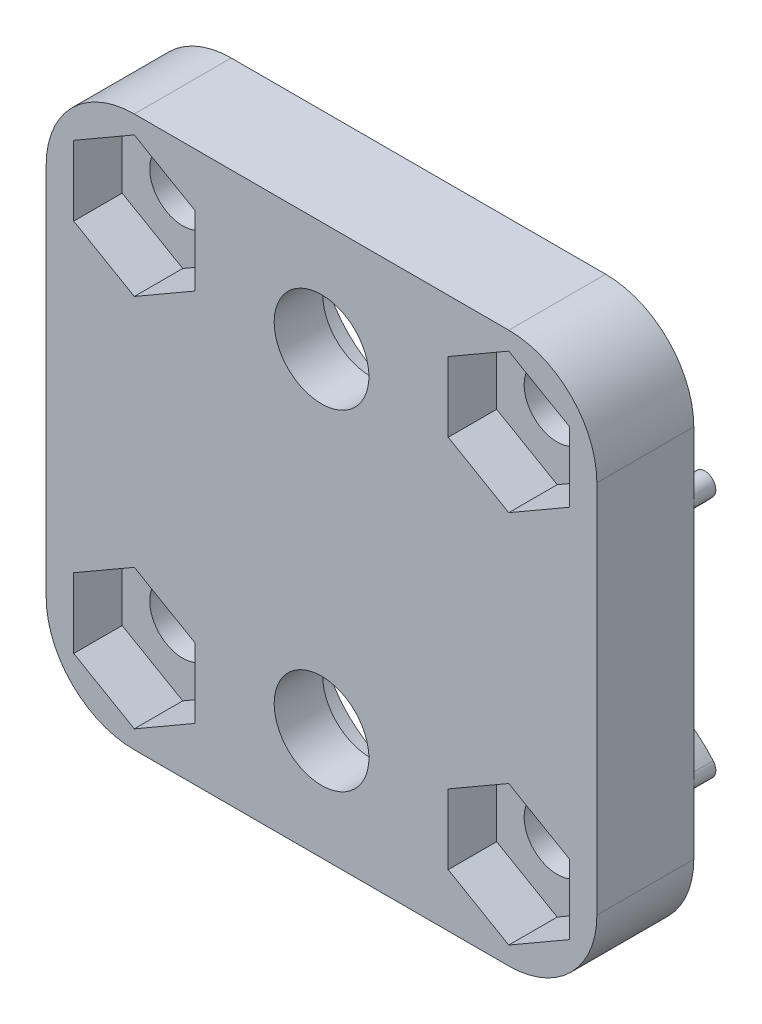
from build123d import *

# Parameters (mm, degrees)
BOSS_EXTRU_1_DEPTH              = 2.2
ENL_V_MAT_EXTRU_1_DEPTH         = 2.2
ESQUISSE3_R                     = 1.5
ENL_V_MAT_EXTRU_2_DEPTH         = 2.2
R_P_TITION_LIN_AIRE1_COUNT      = 10
R_P_TITION_LIN_AIRE1_PITCH      = 17
R_P_TITION_LIN_AIRE1_COUNT_DIR2 = 2
R_P_TITION_LIN_AIRE1_PITCH_DIR2 = 17
ESQUISSE5_R                     = 4.5
ENL_V_MAT_EXTRU_3_DEPTH         = 2.2
ESQUISSE6_R                     = 2.15
ENL_V_MAT_EXTRU_4_DEPTH         = 2.2
BOSS_EXTRU_2_DEPTH              = 1
SYM_TRIE2_COPY_1_DEPTH          = 1


with BuildPart() as part:
    # Esquisse1 → Boss.-Extru.1 (new, symmetric)
    with BuildSketch(Plane.XY):
        with BuildLine():
            Line((17, 21), (0, 21))
            ThreePointArc((0, 21), (-2.828427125, 19.828427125), (-4, 17))
            Line((-4, 17), (-4, 0))
            ThreePointArc((-4, 0), (-2.828427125, -2.828427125), (0, -4))
            Line((0, -4), (17, -4))
            ThreePointArc((17, -4), (19.828427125, -2.828427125), (21, 0))
            Line((21, 0), (21, 17))
            ThreePointArc((21, 17), (19.828427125, 19.828427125), (17, 21))
        make_face()
    extrude(amount=BOSS_EXTRU_1_DEPTH, both=True)

    # Esquisse2 → Enl_v. mat.-Extru.1 (cut)
    with BuildSketch(Plane.XY.offset(2.2)):
        Polygon((19.75, 15.41228676), (19.75, 18.58771324), (17, 20.175426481), (14.25, 18.58771324), (14.25, 15.41228676), (17, 13.824573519), align=None)
    enl_v_mat_extru_1 = extrude(amount=-ENL_V_MAT_EXTRU_1_DEPTH, mode=Mode.SUBTRACT)

    # Esquisse3 → Enl_v. mat.-Extru.2 (cut)
    with BuildSketch(Plane.XY):
        with Locations((17, 17)):
            Circle(ESQUISSE3_R)
    enl_v_mat_extru_2 = extrude(amount=-ENL_V_MAT_EXTRU_2_DEPTH, mode=Mode.SUBTRACT)

    # R_p_tition lin_aire1: Enl_v. mat.-Extru.1, Enl_v. mat.-Extru.2 10 × 2
    with Locations(*[(-i * R_P_TITION_LIN_AIRE1_PITCH, -j * R_P_TITION_LIN_AIRE1_PITCH_DIR2, 0) for i in range(R_P_TITION_LIN_AIRE1_COUNT) for j in range(R_P_TITION_LIN_AIRE1_COUNT_DIR2) if (i, j) != (0, 0)]):
        add(enl_v_mat_extru_1, mode=Mode.SUBTRACT)
        add(enl_v_mat_extru_2, mode=Mode.SUBTRACT)

    # Esquisse5 → Enl_v. mat.-Extru.3 (cut)
    with BuildSketch(Plane(origin=(0, 0, -2.2), x_dir=(-1, 0, 0), z_dir=(0, 0, -1))):
        with Locations((-8.5, 16)):
            Circle(ESQUISSE5_R)
        with Locations((-8.5, 1)):
            Circle(ESQUISSE5_R)
    extrude(amount=-ENL_V_MAT_EXTRU_3_DEPTH, mode=Mode.SUBTRACT)

    # Esquisse6 → Enl_v. mat.-Extru.4 (cut)
    with BuildSketch(Plane(origin=(0, 0, 0), x_dir=(-1, 0, 0), z_dir=(0, 0, -1))):
        with Locations((-8.5, 16)):
            Circle(ESQUISSE6_R)
        with Locations((-8.5, 1)):
            Circle(ESQUISSE6_R)
    extrude(amount=-ENL_V_MAT_EXTRU_4_DEPTH, mode=Mode.SUBTRACT)

    # Esquisse4 → Boss.-Extru.2 (add)
    with BuildSketch(Plane(origin=(0, 0, -2.2), x_dir=(-1, 0, 0), z_dir=(0, 0, -1))):
        with BuildLine():
            ThreePointArc((-20.119565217, 14.339490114), (-17, 12.9), (-13.880434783, 14.339490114))
            ThreePointArc((-13.880434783, 14.339490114), (-13.175547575, 14.395472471), (-13.119565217, 13.690585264))
            ThreePointArc((-13.119565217, 13.690585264), (-17, 11.9), (-20.880434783, 13.690585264))
            ThreePointArc((-20.880434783, 13.690585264), (-20.824452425, 14.395472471), (-20.119565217, 14.339490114))
        make_face()
    boss_extru_2 = extrude(amount=BOSS_EXTRU_2_DEPTH)

    # Sym_trie1: Boss.-Extru.2 across plane
    add(boss_extru_2.mirror(Plane.ZX.offset(8.5)))

    # Sym_trie2: Boss.-Extru.2 across plane
    add(boss_extru_2.mirror(Plane(origin=(8.5, 0, 0), x_dir=(0, 0, 1), z_dir=(1, 0, 0))))

    # Sym_trie2 copy 1 sketch → Sym_trie2 copy 1 (add)
    with BuildSketch(Plane(origin=(17, 17, -2.2), x_dir=(1, 0, 0), z_dir=(0, 0, -1))):
        with BuildLine():
            ThreePointArc((-20.119565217, 14.339490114), (-17, 12.9), (-13.880434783, 14.339490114))
            ThreePointArc((-13.880434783, 14.339490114), (-13.175547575, 14.395472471), (-13.119565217, 13.690585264))
            ThreePointArc((-13.119565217, 13.690585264), (-17, 11.9), (-20.880434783, 13.690585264))
            ThreePointArc((-20.880434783, 13.690585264), (-20.824452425, 14.395472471), (-20.119565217, 14.339490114))
        make_face()
    extrude(amount=SYM_TRIE2_COPY_1_DEPTH)


solid = part.part
